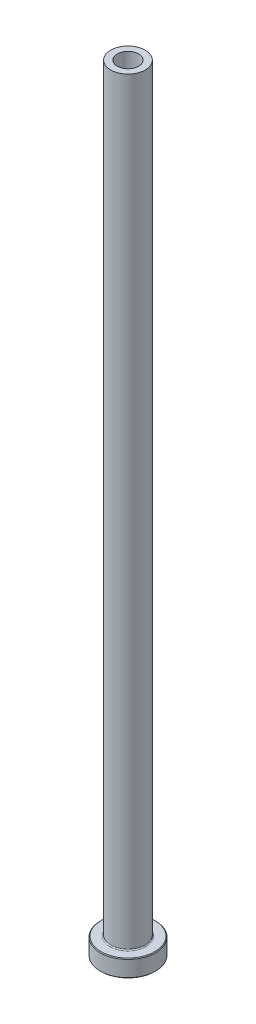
from build123d import *

# Parameters (mm, degrees)
FILLET1_R     = 0.3
CHAMFER1_SIZE = 0.2
CHAMFER3_SIZE = 0.5


with BuildPart() as part:
    # Sketch1 → Revolve1 (revolve)
    with BuildSketch(Plane.XY, mode=Mode.PRIVATE) as revolve1_sk:
        Polygon((-3.1, 225), (-5, 225), (-5, 5), (-8, 5), (-8, 0), (-3.35, 0), (-3.35, 168), (-3.1, 180), align=None)
    revolve(revolve1_sk.sketch.rotate(Axis((0, 92.187680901, 0), (0, -1, 0)), 270), axis=Axis((0, 92.187680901, 0), (0, -1, 0)))

    # Fillet1
    fillet1_edges = [part.edges().sort_by_distance(p)[0] for p in [
        (0, 5, -5),
    ]]
    fillet(fillet1_edges, radius=FILLET1_R)

    # Chamfer1
    chamfer1_edges = [part.edges().sort_by_distance(p)[0] for p in [
        (0, 0, -8),
        (0, 5, -8),
    ]]
    chamfer(chamfer1_edges, length=CHAMFER1_SIZE)

    # Chamfer3
    chamfer3_edges = [part.edges().sort_by_distance(p)[0] for p in [
        (0, 0, -3.35),
    ]]
    chamfer(chamfer3_edges, length=CHAMFER3_SIZE)


solid = part.part
